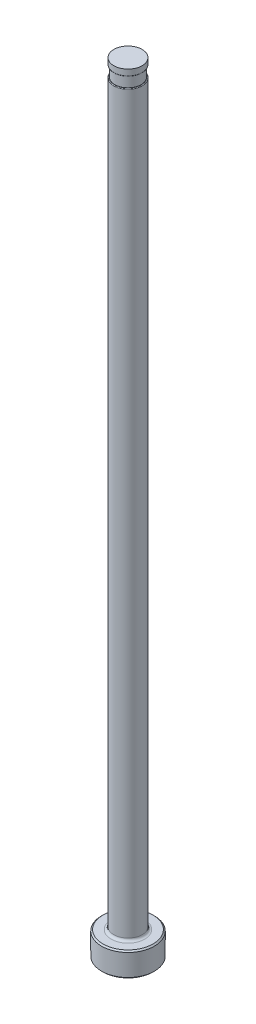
from build123d import *

# Parameters (mm, degrees)
CHAMFER1_SIZE     = 0.254
FILLET1_R         = 0.508
SKETCH2_W         = 0.2032
SKETCH2_H         = 2.032
D_SLOT_DEPTH      = 153.574351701
D_SLOT_DEPTH_BACK = 153.574351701
SKETCH5_W         = 0.0127
SKETCH5_H         = 1.27
FILLET2_R         = 0.127


with BuildPart() as part:
    # Sketch1 → Revolve1 (revolve)
    with BuildSketch(Plane.XY, mode=Mode.PRIVATE) as revolve1_sk:
        Polygon((0, 0), (-5.1562, 0), (-5.1562, 4.7498), (-2.77749, 4.7498), (-2.77749, 152.4), (0, 152.4), align=None)
    revolve(revolve1_sk.sketch.rotate(Axis((0, 259.958771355, 0), (0, -1, 0)), 270), axis=Axis((0, 259.958771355, 0), (0, -1, 0)))

    # Chamfer1
    chamfer1_edges = [part.edges().sort_by_distance(p)[0] for p in [
        (0, 4.7498, -5.1562),
        (0, 0, -5.1562),
    ]]
    chamfer(chamfer1_edges, length=CHAMFER1_SIZE)

    # Fillet1
    fillet1_edges = [part.edges().sort_by_distance(p)[0] for p in [
        (0, 4.7498, -2.77749),
    ]]
    fillet(fillet1_edges, radius=FILLET1_R)

    # Sketch2 → Vent Relief (revolve, cut)
    with BuildSketch(Plane.XY, mode=Mode.PRIVATE) as vent_relief_sk:
        with Locations((-2.67589, 150.114)):
            Rectangle(SKETCH2_W, SKETCH2_H)
    revolve(vent_relief_sk.sketch.rotate(Axis((0, 153.448281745, 0), (0, -1, 0)), 270), axis=Axis((0, 153.448281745, 0), (0, -1, 0)), mode=Mode.SUBTRACT)

    # Sketch3 → D-Slot (cut, two sides: drawn at the far end of the back side and taken through both)
    with BuildSketch(Plane.XY.offset(-D_SLOT_DEPTH_BACK)):
        with BuildLine():
            Line((-2.57429, 150.114), (-2.57429, 86.614))
            ThreePointArc((-2.57429, 86.614), (-2.625503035, 86.046038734), (-2.77749, 85.4964))
            Line((-2.77749, 85.4964), (-2.77749, 150.114))
            Line((-2.77749, 150.114), (-2.57429, 150.114))
        make_face()
    extrude(amount=D_SLOT_DEPTH + D_SLOT_DEPTH_BACK, mode=Mode.SUBTRACT)

    # Sketch5 → Vent Diameter (revolve, cut)
    with BuildSketch(Plane.XY, mode=Mode.PRIVATE) as vent_diameter_sk:
        with Locations((-2.77114, 151.765)):
            Rectangle(SKETCH5_W, SKETCH5_H)
    revolve(vent_diameter_sk.sketch.rotate(Axis((0, 152.687735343, 0), (0, -1, 0)), 90), axis=Axis((0, 152.687735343, 0), (0, -1, 0)), mode=Mode.SUBTRACT)

    # Fillet2
    fillet2_edges = [part.edges().sort_by_distance(p)[0] for p in [
        (2.303354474, 149.098, -1.552098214),
        (0, 151.13, 2.76479),
    ]]
    fillet(fillet2_edges, radius=FILLET2_R)


solid = part.part
